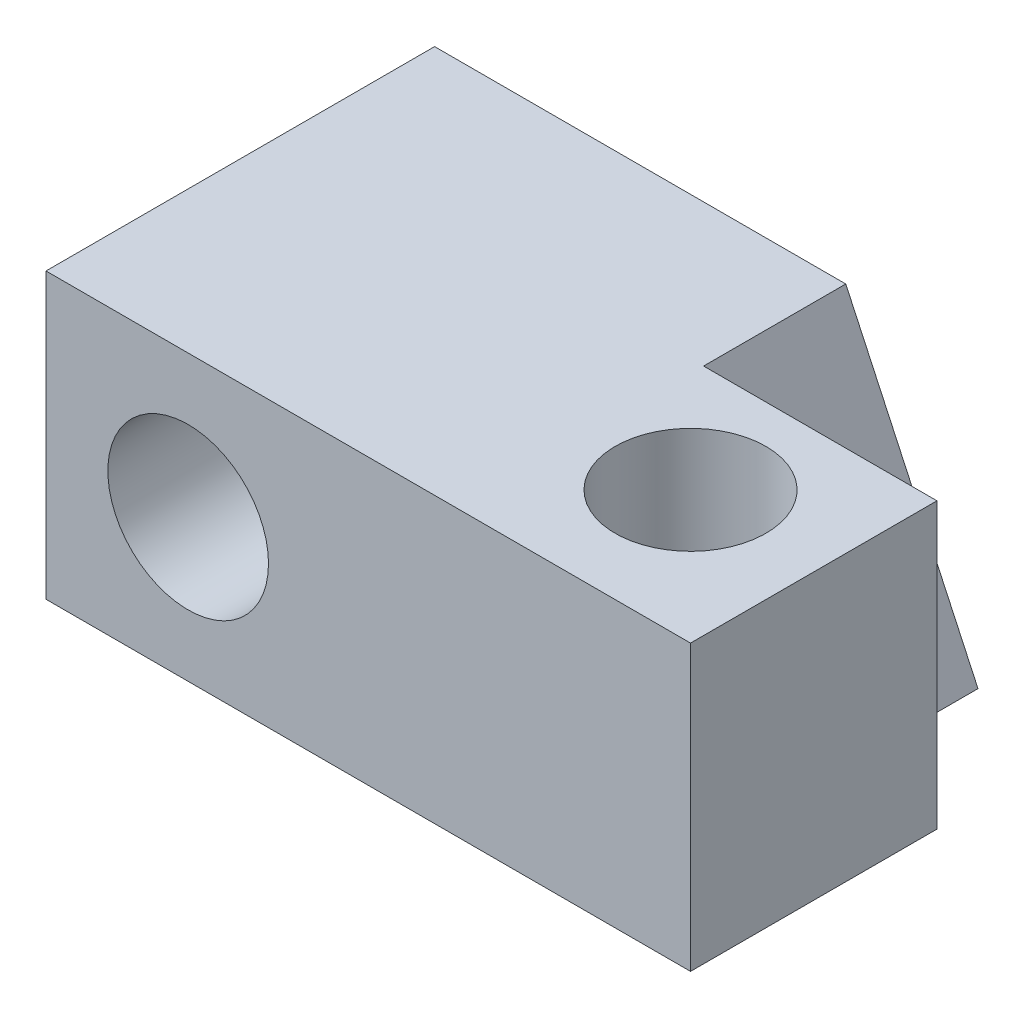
ISO-10303-21;
HEADER;
FILE_DESCRIPTION(('STEP AP214'),'2;1');
FILE_NAME('part.step','',(''),(''),'','','');
FILE_SCHEMA(('AUTOMOTIVE_DESIGN { 1 0 10303 214 1 1 1 1 }'));
ENDSEC;
DATA;
#1=APPLICATION_CONTEXT('core data for automotive mechanical design processes');
#2=APPLICATION_PROTOCOL_DEFINITION('international standard','automotive_design',2000,#1);
#3=PRODUCT_CONTEXT('',#1,'mechanical');
#4=PRODUCT('Part','Part','',(#3));
#5=PRODUCT_RELATED_PRODUCT_CATEGORY('part','',(#4));
#6=PRODUCT_DEFINITION_FORMATION('','',#4);
#7=PRODUCT_DEFINITION_CONTEXT('part definition',#1,'design');
#8=PRODUCT_DEFINITION('design','',#6,#7);
#9=PRODUCT_DEFINITION_SHAPE('','',#8);
#10=(LENGTH_UNIT() NAMED_UNIT(*) SI_UNIT(.MILLI.,.METRE.));
#11=(NAMED_UNIT(*) PLANE_ANGLE_UNIT() SI_UNIT($,.RADIAN.));
#12=(NAMED_UNIT(*) SI_UNIT($,.STERADIAN.) SOLID_ANGLE_UNIT());
#13=UNCERTAINTY_MEASURE_WITH_UNIT(LENGTH_MEASURE(1.E-05),#10,'distance_accuracy_value','');
#14=(GEOMETRIC_REPRESENTATION_CONTEXT(3) GLOBAL_UNCERTAINTY_ASSIGNED_CONTEXT((#13)) GLOBAL_UNIT_ASSIGNED_CONTEXT((#10,
#11,#12)) REPRESENTATION_CONTEXT('',''));
#15=CARTESIAN_POINT('',(0.,0.,0.));
#16=DIRECTION('',(0.,0.,1.));
#17=DIRECTION('',(1.,0.,0.));
#18=AXIS2_PLACEMENT_3D('',#15,#16,#17);
#19=CARTESIAN_POINT('',(17.272,0.,10.414));
#20=DIRECTION('',(-1.,0.,0.));
#21=DIRECTION('',(0.,0.,1.));
#22=AXIS2_PLACEMENT_3D('',#19,#20,#21);
#23=PLANE('',#22);
#24=DIRECTION('',(0.,-1.,0.));
#25=VECTOR('',#24,1.);
#26=CARTESIAN_POINT('',(17.272,7.62000000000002,3.81));
#27=LINE('',#26,#25);
#28=CARTESIAN_POINT('',(17.272,7.62000000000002,3.81));
#29=VERTEX_POINT('',#28);
#30=CARTESIAN_POINT('',(17.272,0.,3.81));
#31=VERTEX_POINT('',#30);
#32=EDGE_CURVE('E147',#29,#31,#27,.T.);
#33=ORIENTED_EDGE('',*,*,#32,.F.);
#34=DIRECTION('',(0.,0.,-1.));
#35=VECTOR('',#34,1.);
#36=CARTESIAN_POINT('',(17.272,7.62,10.414));
#37=LINE('',#36,#35);
#38=CARTESIAN_POINT('',(17.272,7.62,10.414));
#39=VERTEX_POINT('',#38);
#40=EDGE_CURVE('E139',#39,#29,#37,.T.);
#41=ORIENTED_EDGE('',*,*,#40,.F.);
#42=DIRECTION('',(0.,1.,0.));
#43=VECTOR('',#42,1.);
#44=CARTESIAN_POINT('',(17.272,0.,10.414));
#45=LINE('',#44,#43);
#46=CARTESIAN_POINT('',(17.272,0.,10.414));
#47=VERTEX_POINT('',#46);
#48=EDGE_CURVE('E133',#47,#39,#45,.T.);
#49=ORIENTED_EDGE('',*,*,#48,.F.);
#50=DIRECTION('',(0.,0.,-1.));
#51=VECTOR('',#50,1.);
#52=CARTESIAN_POINT('',(17.272,0.,10.414));
#53=LINE('',#52,#51);
#54=EDGE_CURVE('E52',#47,#31,#53,.T.);
#55=ORIENTED_EDGE('',*,*,#54,.T.);
#56=EDGE_LOOP('',(#33,#41,#49,#55));
#57=FACE_BOUND('',#56,.T.);
#58=ADVANCED_FACE('F44',(#57),#23,.F.);
#59=CARTESIAN_POINT('',(0.,7.62,0.));
#60=DIRECTION('',(0.,0.,-1.));
#61=DIRECTION('',(-1.,0.,0.));
#62=AXIS2_PLACEMENT_3D('',#59,#60,#61);
#63=PLANE('',#62);
#64=DIRECTION('',(-0.421660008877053,0.906754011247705,0.));
#65=VECTOR('',#64,1.);
#66=CARTESIAN_POINT('',(11.0182253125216,7.62,0.));
#67=LINE('',#66,#65);
#68=CARTESIAN_POINT('',(14.561688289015,0.,0.));
#69=VERTEX_POINT('',#68);
#70=CARTESIAN_POINT('',(11.0182253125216,7.62,0.));
#71=VERTEX_POINT('',#70);
#72=EDGE_CURVE('E103',#69,#71,#67,.T.);
#73=ORIENTED_EDGE('',*,*,#72,.F.);
#74=DIRECTION('',(1.,0.,0.));
#75=VECTOR('',#74,1.);
#76=CARTESIAN_POINT('',(0.,0.,0.));
#77=LINE('',#76,#75);
#78=CARTESIAN_POINT('',(0.,0.,0.));
#79=VERTEX_POINT('',#78);
#80=EDGE_CURVE('E115',#79,#69,#77,.T.);
#81=ORIENTED_EDGE('',*,*,#80,.F.);
#82=DIRECTION('',(0.,-1.,0.));
#83=VECTOR('',#82,1.);
#84=CARTESIAN_POINT('',(0.,0.,0.));
#85=LINE('',#84,#83);
#86=CARTESIAN_POINT('',(0.,7.62,0.));
#87=VERTEX_POINT('',#86);
#88=EDGE_CURVE('E122',#87,#79,#85,.T.);
#89=ORIENTED_EDGE('',*,*,#88,.F.);
#90=DIRECTION('',(-1.,0.,0.));
#91=VECTOR('',#90,1.);
#92=CARTESIAN_POINT('',(0.,7.62,0.));
#93=LINE('',#92,#91);
#94=EDGE_CURVE('E116',#71,#87,#93,.T.);
#95=ORIENTED_EDGE('',*,*,#94,.F.);
#96=EDGE_LOOP('',(#73,#81,#89,#95));
#97=FACE_BOUND('',#96,.T.);
#98=CARTESIAN_POINT('',(9.779,2.54,0.));
#99=DIRECTION('',(0.,0.,-1.));
#100=DIRECTION('',(-1.,0.,0.));
#101=AXIS2_PLACEMENT_3D('',#98,#99,#100);
#102=CIRCLE('',#101,1.5875);
#103=CARTESIAN_POINT('',(8.1915,2.54,0.));
#104=VERTEX_POINT('',#103);
#105=EDGE_CURVE('E158',#104,#104,#102,.T.);
#106=ORIENTED_EDGE('',*,*,#105,.F.);
#107=EDGE_LOOP('',(#106));
#108=FACE_BOUND('',#107,.T.);
#109=CARTESIAN_POINT('',(3.81,3.81,0.));
#110=DIRECTION('',(0.,0.,1.));
#111=DIRECTION('',(1.,0.,0.));
#112=AXIS2_PLACEMENT_3D('',#109,#110,#111);
#113=CIRCLE('',#112,2.15265);
#114=CARTESIAN_POINT('',(5.96265,3.81,0.));
#115=VERTEX_POINT('',#114);
#116=EDGE_CURVE('E161',#115,#115,#113,.T.);
#117=ORIENTED_EDGE('',*,*,#116,.T.);
#118=EDGE_LOOP('',(#117));
#119=FACE_BOUND('',#118,.T.);
#120=ADVANCED_FACE('F112',(#97,#108,#119),#63,.T.);
#121=CARTESIAN_POINT('',(0.,0.,10.414));
#122=DIRECTION('',(1.,0.,0.));
#123=DIRECTION('',(0.,0.,-1.));
#124=AXIS2_PLACEMENT_3D('',#121,#122,#123);
#125=PLANE('',#124);
#126=ORIENTED_EDGE('',*,*,#88,.T.);
#127=DIRECTION('',(0.,0.,-1.));
#128=VECTOR('',#127,1.);
#129=CARTESIAN_POINT('',(0.,0.,10.414));
#130=LINE('',#129,#128);
#131=CARTESIAN_POINT('',(0.,0.,10.414));
#132=VERTEX_POINT('',#131);
#133=EDGE_CURVE('E13',#132,#79,#130,.T.);
#134=ORIENTED_EDGE('',*,*,#133,.F.);
#135=DIRECTION('',(0.,-1.,0.));
#136=VECTOR('',#135,1.);
#137=CARTESIAN_POINT('',(0.,0.,10.414));
#138=LINE('',#137,#136);
#139=CARTESIAN_POINT('',(0.,7.62,10.414));
#140=VERTEX_POINT('',#139);
#141=EDGE_CURVE('E124',#140,#132,#138,.T.);
#142=ORIENTED_EDGE('',*,*,#141,.F.);
#143=DIRECTION('',(0.,0.,-1.));
#144=VECTOR('',#143,1.);
#145=CARTESIAN_POINT('',(0.,7.62,10.414));
#146=LINE('',#145,#144);
#147=EDGE_CURVE('E136',#140,#87,#146,.T.);
#148=ORIENTED_EDGE('',*,*,#147,.T.);
#149=EDGE_LOOP('',(#126,#134,#142,#148));
#150=FACE_BOUND('',#149,.T.);
#151=ADVANCED_FACE('F46',(#150),#125,.F.);
#152=CARTESIAN_POINT('',(0.,0.,10.414));
#153=DIRECTION('',(0.,1.,0.));
#154=DIRECTION('',(0.,0.,1.));
#155=AXIS2_PLACEMENT_3D('',#152,#153,#154);
#156=PLANE('',#155);
#157=CARTESIAN_POINT('',(13.716,0.,6.858));
#158=DIRECTION('',(0.,-1.,0.));
#159=DIRECTION('',(0.,0.,-1.));
#160=AXIS2_PLACEMENT_3D('',#157,#158,#159);
#161=CIRCLE('',#160,2.01929999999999);
#162=CARTESIAN_POINT('',(13.716,0.,4.83870000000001));
#163=VERTEX_POINT('',#162);
#164=EDGE_CURVE('E126',#163,#163,#161,.T.);
#165=ORIENTED_EDGE('',*,*,#164,.F.);
#166=EDGE_LOOP('',(#165));
#167=FACE_BOUND('',#166,.T.);
#168=ORIENTED_EDGE('',*,*,#80,.T.);
#169=DIRECTION('',(0.,0.,-1.));
#170=VECTOR('',#169,1.);
#171=CARTESIAN_POINT('',(14.561688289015,0.,3.81));
#172=LINE('',#171,#170);
#173=CARTESIAN_POINT('',(14.561688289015,0.,3.81));
#174=VERTEX_POINT('',#173);
#175=EDGE_CURVE('E100',#174,#69,#172,.T.);
#176=ORIENTED_EDGE('',*,*,#175,.F.);
#177=DIRECTION('',(-1.,0.,0.));
#178=VECTOR('',#177,1.);
#179=CARTESIAN_POINT('',(17.272,0.,3.81));
#180=LINE('',#179,#178);
#181=EDGE_CURVE('E148',#31,#174,#180,.T.);
#182=ORIENTED_EDGE('',*,*,#181,.F.);
#183=ORIENTED_EDGE('',*,*,#54,.F.);
#184=DIRECTION('',(1.,0.,0.));
#185=VECTOR('',#184,1.);
#186=CARTESIAN_POINT('',(0.,0.,10.414));
#187=LINE('',#186,#185);
#188=EDGE_CURVE('E131',#132,#47,#187,.T.);
#189=ORIENTED_EDGE('',*,*,#188,.F.);
#190=ORIENTED_EDGE('',*,*,#133,.T.);
#191=EDGE_LOOP('',(#168,#176,#182,#183,#189,#190));
#192=FACE_BOUND('',#191,.T.);
#193=ADVANCED_FACE('F119',(#167,#192),#156,.F.);
#194=CARTESIAN_POINT('',(0.,7.62,10.414));
#195=DIRECTION('',(0.,-1.,0.));
#196=DIRECTION('',(0.,0.,-1.));
#197=AXIS2_PLACEMENT_3D('',#194,#195,#196);
#198=PLANE('',#197);
#199=CARTESIAN_POINT('',(13.716,7.62,6.858));
#200=DIRECTION('',(0.,-1.,0.));
#201=DIRECTION('',(0.,0.,-1.));
#202=AXIS2_PLACEMENT_3D('',#199,#200,#201);
#203=CIRCLE('',#202,2.0193);
#204=CARTESIAN_POINT('',(13.716,7.62,4.8387));
#205=VERTEX_POINT('',#204);
#206=EDGE_CURVE('E167',#205,#205,#203,.T.);
#207=ORIENTED_EDGE('',*,*,#206,.T.);
#208=EDGE_LOOP('',(#207));
#209=FACE_BOUND('',#208,.T.);
#210=DIRECTION('',(1.,0.,0.));
#211=VECTOR('',#210,1.);
#212=CARTESIAN_POINT('',(11.0182253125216,7.62,3.81));
#213=LINE('',#212,#211);
#214=CARTESIAN_POINT('',(11.0182253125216,7.62,3.81));
#215=VERTEX_POINT('',#214);
#216=EDGE_CURVE('E117',#215,#29,#213,.T.);
#217=ORIENTED_EDGE('',*,*,#216,.F.);
#218=DIRECTION('',(0.,0.,-1.));
#219=VECTOR('',#218,1.);
#220=CARTESIAN_POINT('',(11.0182253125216,7.62,3.81));
#221=LINE('',#220,#219);
#222=EDGE_CURVE('E108',#215,#71,#221,.T.);
#223=ORIENTED_EDGE('',*,*,#222,.T.);
#224=ORIENTED_EDGE('',*,*,#94,.T.);
#225=ORIENTED_EDGE('',*,*,#147,.F.);
#226=DIRECTION('',(-1.,0.,0.));
#227=VECTOR('',#226,1.);
#228=CARTESIAN_POINT('',(0.,7.62,10.414));
#229=LINE('',#228,#227);
#230=EDGE_CURVE('E67',#39,#140,#229,.T.);
#231=ORIENTED_EDGE('',*,*,#230,.F.);
#232=ORIENTED_EDGE('',*,*,#40,.T.);
#233=EDGE_LOOP('',(#217,#223,#224,#225,#231,#232));
#234=FACE_BOUND('',#233,.T.);
#235=ADVANCED_FACE('F175',(#209,#234),#198,.F.);
#236=CARTESIAN_POINT('',(0.,7.62,10.414));
#237=DIRECTION('',(0.,0.,-1.));
#238=DIRECTION('',(-1.,0.,0.));
#239=AXIS2_PLACEMENT_3D('',#236,#237,#238);
#240=PLANE('',#239);
#241=CARTESIAN_POINT('',(3.81,3.81,10.414));
#242=DIRECTION('',(0.,0.,1.));
#243=DIRECTION('',(1.,0.,0.));
#244=AXIS2_PLACEMENT_3D('',#241,#242,#243);
#245=CIRCLE('',#244,2.15265);
#246=CARTESIAN_POINT('',(5.96265,3.81,10.414));
#247=VERTEX_POINT('',#246);
#248=EDGE_CURVE('E164',#247,#247,#245,.T.);
#249=ORIENTED_EDGE('',*,*,#248,.F.);
#250=EDGE_LOOP('',(#249));
#251=FACE_BOUND('',#250,.T.);
#252=ORIENTED_EDGE('',*,*,#141,.T.);
#253=ORIENTED_EDGE('',*,*,#188,.T.);
#254=ORIENTED_EDGE('',*,*,#48,.T.);
#255=ORIENTED_EDGE('',*,*,#230,.T.);
#256=EDGE_LOOP('',(#252,#253,#254,#255));
#257=FACE_BOUND('',#256,.T.);
#258=ADVANCED_FACE('F180',(#251,#257),#240,.F.);
#259=CARTESIAN_POINT('',(13.716,0.,6.858));
#260=DIRECTION('',(0.,-1.,0.));
#261=DIRECTION('',(0.,0.,-1.));
#262=AXIS2_PLACEMENT_3D('',#259,#260,#261);
#263=CYLINDRICAL_SURFACE('',#262,2.01929999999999);
#264=ORIENTED_EDGE('',*,*,#206,.F.);
#265=EDGE_LOOP('',(#264));
#266=FACE_BOUND('',#265,.T.);
#267=ORIENTED_EDGE('',*,*,#164,.T.);
#268=EDGE_LOOP('',(#267));
#269=FACE_BOUND('',#268,.T.);
#270=ADVANCED_FACE('F172',(#266,#269),#263,.F.);
#271=CARTESIAN_POINT('',(3.81,3.81,10.414));
#272=DIRECTION('',(0.,0.,1.));
#273=DIRECTION('',(1.,0.,0.));
#274=AXIS2_PLACEMENT_3D('',#271,#272,#273);
#275=CYLINDRICAL_SURFACE('',#274,2.15265);
#276=ORIENTED_EDGE('',*,*,#116,.F.);
#277=EDGE_LOOP('',(#276));
#278=FACE_BOUND('',#277,.T.);
#279=ORIENTED_EDGE('',*,*,#248,.T.);
#280=EDGE_LOOP('',(#279));
#281=FACE_BOUND('',#280,.T.);
#282=ADVANCED_FACE('F196',(#278,#281),#275,.F.);
#283=CARTESIAN_POINT('',(9.779,2.54,0.));
#284=DIRECTION('',(0.,0.,-1.));
#285=DIRECTION('',(-1.,0.,0.));
#286=AXIS2_PLACEMENT_3D('',#283,#284,#285);
#287=CYLINDRICAL_SURFACE('',#286,1.5875);
#288=CARTESIAN_POINT('',(9.779,2.54,5.08));
#289=DIRECTION('',(0.,0.,-1.));
#290=DIRECTION('',(-1.,0.,0.));
#291=AXIS2_PLACEMENT_3D('',#288,#289,#290);
#292=CIRCLE('',#291,1.5875);
#293=CARTESIAN_POINT('',(8.1915,2.54,5.08));
#294=VERTEX_POINT('',#293);
#295=EDGE_CURVE('E154',#294,#294,#292,.T.);
#296=ORIENTED_EDGE('',*,*,#295,.F.);
#297=EDGE_LOOP('',(#296));
#298=FACE_BOUND('',#297,.T.);
#299=ORIENTED_EDGE('',*,*,#105,.T.);
#300=EDGE_LOOP('',(#299));
#301=FACE_BOUND('',#300,.T.);
#302=ADVANCED_FACE('F200',(#298,#301),#287,.F.);
#303=CARTESIAN_POINT('',(9.779,2.54,5.08));
#304=DIRECTION('',(0.,0.,-1.));
#305=DIRECTION('',(-1.,0.,0.));
#306=AXIS2_PLACEMENT_3D('',#303,#304,#305);
#307=CONICAL_SURFACE('',#306,1.5875,1.02974425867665);
#308=CARTESIAN_POINT('',(9.779,2.54,6.03386623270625));
#309=VERTEX_POINT('',#308);
#310=VERTEX_LOOP('',#309);
#311=FACE_BOUND('',#310,.T.);
#312=ORIENTED_EDGE('',*,*,#295,.T.);
#313=EDGE_LOOP('',(#312));
#314=FACE_BOUND('',#313,.T.);
#315=ADVANCED_FACE('F204',(#311,#314),#307,.F.);
#316=CARTESIAN_POINT('',(11.0182253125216,7.62,3.81));
#317=DIRECTION('',(-0.906754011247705,-0.421660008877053,0.));
#318=DIRECTION('',(0.421660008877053,-0.906754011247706,0.));
#319=AXIS2_PLACEMENT_3D('',#316,#317,#318);
#320=PLANE('',#319);
#321=ORIENTED_EDGE('',*,*,#72,.T.);
#322=ORIENTED_EDGE('',*,*,#222,.F.);
#323=DIRECTION('',(-0.421660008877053,0.906754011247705,0.));
#324=VECTOR('',#323,1.);
#325=CARTESIAN_POINT('',(11.0182253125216,7.62,3.81));
#326=LINE('',#325,#324);
#327=EDGE_CURVE('E59',#174,#215,#326,.T.);
#328=ORIENTED_EDGE('',*,*,#327,.F.);
#329=ORIENTED_EDGE('',*,*,#175,.T.);
#330=EDGE_LOOP('',(#321,#322,#328,#329));
#331=FACE_BOUND('',#330,.T.);
#332=ADVANCED_FACE('F102',(#331),#320,.F.);
#333=CARTESIAN_POINT('',(17.272,7.62000000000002,3.81));
#334=DIRECTION('',(0.,0.,-1.));
#335=DIRECTION('',(0.,1.,0.));
#336=AXIS2_PLACEMENT_3D('',#333,#334,#335);
#337=PLANE('',#336);
#338=ORIENTED_EDGE('',*,*,#216,.T.);
#339=ORIENTED_EDGE('',*,*,#32,.T.);
#340=ORIENTED_EDGE('',*,*,#181,.T.);
#341=ORIENTED_EDGE('',*,*,#327,.T.);
#342=EDGE_LOOP('',(#338,#339,#340,#341));
#343=FACE_BOUND('',#342,.T.);
#344=ADVANCED_FACE('F211',(#343),#337,.T.);
#345=CLOSED_SHELL('',(#58,#120,#151,#193,#235,#258,#270,#282,#302,#315,#332,#344));
#346=MANIFOLD_SOLID_BREP('B2',#345);
#347=ADVANCED_BREP_SHAPE_REPRESENTATION('',(#18,#346),#14);
#348=SHAPE_DEFINITION_REPRESENTATION(#9,#347);
ENDSEC;
END-ISO-10303-21;
